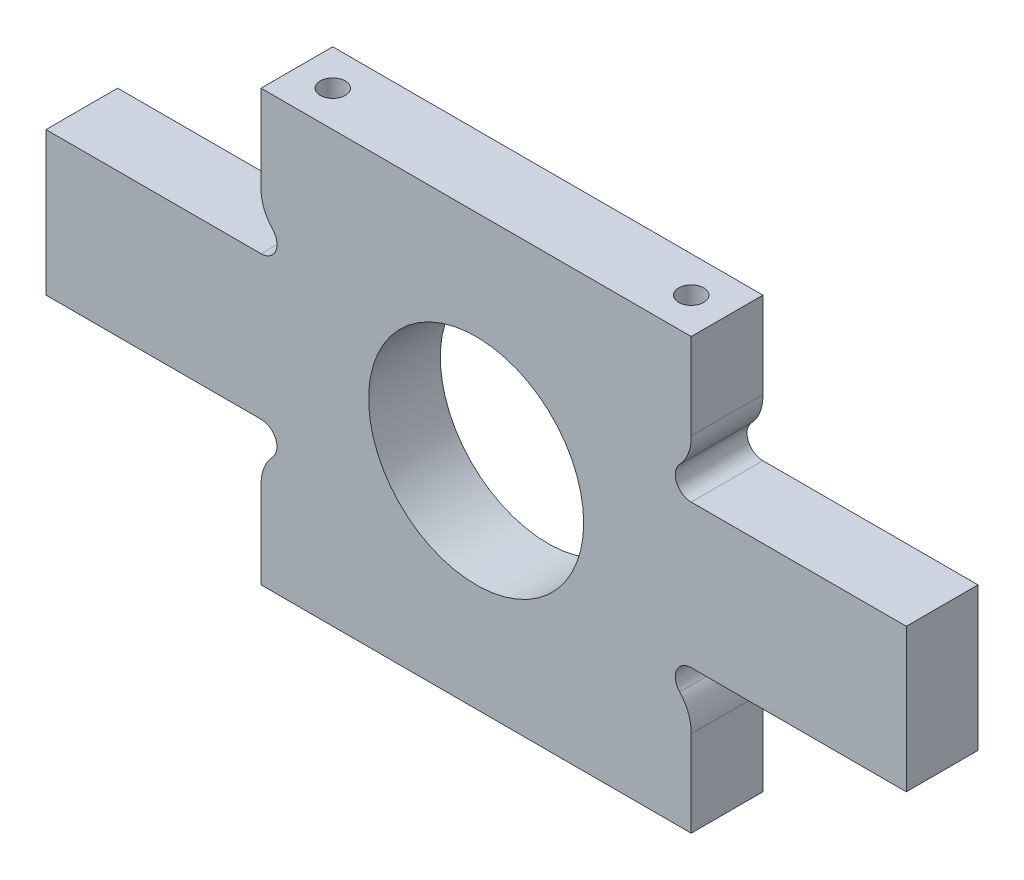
ISO-10303-21;
HEADER;
FILE_DESCRIPTION(('STEP AP214'),'2;1');
FILE_NAME('part.step','',(''),(''),'','','');
FILE_SCHEMA(('AUTOMOTIVE_DESIGN { 1 0 10303 214 1 1 1 1 }'));
ENDSEC;
DATA;
#1=APPLICATION_CONTEXT('core data for automotive mechanical design processes');
#2=APPLICATION_PROTOCOL_DEFINITION('international standard','automotive_design',2000,#1);
#3=PRODUCT_CONTEXT('',#1,'mechanical');
#4=PRODUCT('Part','Part','',(#3));
#5=PRODUCT_RELATED_PRODUCT_CATEGORY('part','',(#4));
#6=PRODUCT_DEFINITION_FORMATION('','',#4);
#7=PRODUCT_DEFINITION_CONTEXT('part definition',#1,'design');
#8=PRODUCT_DEFINITION('design','',#6,#7);
#9=PRODUCT_DEFINITION_SHAPE('','',#8);
#10=(LENGTH_UNIT() NAMED_UNIT(*) SI_UNIT(.MILLI.,.METRE.));
#11=(NAMED_UNIT(*) PLANE_ANGLE_UNIT() SI_UNIT($,.RADIAN.));
#12=(NAMED_UNIT(*) SI_UNIT($,.STERADIAN.) SOLID_ANGLE_UNIT());
#13=UNCERTAINTY_MEASURE_WITH_UNIT(LENGTH_MEASURE(1.E-05),#10,'distance_accuracy_value','');
#14=(GEOMETRIC_REPRESENTATION_CONTEXT(3) GLOBAL_UNCERTAINTY_ASSIGNED_CONTEXT((#13)) GLOBAL_UNIT_ASSIGNED_CONTEXT((#10,
#11,#12)) REPRESENTATION_CONTEXT('',''));
#15=CARTESIAN_POINT('',(0.,0.,0.));
#16=DIRECTION('',(0.,0.,1.));
#17=DIRECTION('',(1.,0.,0.));
#18=AXIS2_PLACEMENT_3D('',#15,#16,#17);
#19=CARTESIAN_POINT('',(24.0021116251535,17.8408301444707,10.));
#20=DIRECTION('',(0.,0.,-1.));
#21=DIRECTION('',(-1.,0.,0.));
#22=AXIS2_PLACEMENT_3D('',#19,#20,#21);
#23=CYLINDRICAL_SURFACE('',#22,6.00000000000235);
#24=CARTESIAN_POINT('',(24.0021116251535,17.8408301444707,0.));
#25=DIRECTION('',(0.,0.,1.));
#26=DIRECTION('',(-1.,0.,0.));
#27=AXIS2_PLACEMENT_3D('',#24,#25,#26);
#28=CIRCLE('',#27,6.00000000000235);
#29=CARTESIAN_POINT('',(28.3795620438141,13.7374257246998,0.));
#30=VERTEX_POINT('',#29);
#31=CARTESIAN_POINT('',(30.,18.,0.));
#32=VERTEX_POINT('',#31);
#33=EDGE_CURVE('E212',#30,#32,#28,.T.);
#34=ORIENTED_EDGE('',*,*,#33,.T.);
#35=DIRECTION('',(0.,0.,-1.));
#36=VECTOR('',#35,1.);
#37=CARTESIAN_POINT('',(30.,18.,10.));
#38=LINE('',#37,#36);
#39=CARTESIAN_POINT('',(30.,18.,10.));
#40=VERTEX_POINT('',#39);
#41=EDGE_CURVE('E11',#40,#32,#38,.T.);
#42=ORIENTED_EDGE('',*,*,#41,.F.);
#43=CARTESIAN_POINT('',(24.0021116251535,17.8408301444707,10.));
#44=DIRECTION('',(0.,0.,1.));
#45=DIRECTION('',(-1.,0.,0.));
#46=AXIS2_PLACEMENT_3D('',#43,#44,#45);
#47=CIRCLE('',#46,6.00000000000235);
#48=CARTESIAN_POINT('',(28.3795620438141,13.7374257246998,10.));
#49=VERTEX_POINT('',#48);
#50=EDGE_CURVE('E251',#49,#40,#47,.T.);
#51=ORIENTED_EDGE('',*,*,#50,.F.);
#52=DIRECTION('',(0.,0.,-1.));
#53=VECTOR('',#52,1.);
#54=CARTESIAN_POINT('',(28.3795620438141,13.7374257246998,10.));
#55=LINE('',#54,#53);
#56=EDGE_CURVE('E208',#49,#30,#55,.T.);
#57=ORIENTED_EDGE('',*,*,#56,.T.);
#58=EDGE_LOOP('',(#34,#42,#51,#57));
#59=FACE_BOUND('',#58,.T.);
#60=ADVANCED_FACE('F44',(#59),#23,.T.);
#61=CARTESIAN_POINT('',(30.,30.,10.));
#62=DIRECTION('',(-1.,0.,0.));
#63=DIRECTION('',(0.,-1.,0.));
#64=AXIS2_PLACEMENT_3D('',#61,#62,#63);
#65=PLANE('',#64);
#66=DIRECTION('',(0.,1.,0.));
#67=VECTOR('',#66,1.);
#68=CARTESIAN_POINT('',(30.,30.,0.));
#69=LINE('',#68,#67);
#70=CARTESIAN_POINT('',(30.,30.,0.));
#71=VERTEX_POINT('',#70);
#72=EDGE_CURVE('E215',#32,#71,#69,.T.);
#73=ORIENTED_EDGE('',*,*,#72,.T.);
#74=DIRECTION('',(0.,0.,-1.));
#75=VECTOR('',#74,1.);
#76=CARTESIAN_POINT('',(30.,30.,10.));
#77=LINE('',#76,#75);
#78=CARTESIAN_POINT('',(30.,30.,10.));
#79=VERTEX_POINT('',#78);
#80=EDGE_CURVE('E52',#79,#71,#77,.T.);
#81=ORIENTED_EDGE('',*,*,#80,.F.);
#82=DIRECTION('',(0.,1.,0.));
#83=VECTOR('',#82,1.);
#84=CARTESIAN_POINT('',(30.,30.,10.));
#85=LINE('',#84,#83);
#86=EDGE_CURVE('E139',#40,#79,#85,.T.);
#87=ORIENTED_EDGE('',*,*,#86,.F.);
#88=ORIENTED_EDGE('',*,*,#41,.T.);
#89=EDGE_LOOP('',(#73,#81,#87,#88));
#90=FACE_BOUND('',#89,.T.);
#91=ADVANCED_FACE('F370',(#90),#65,.F.);
#92=CARTESIAN_POINT('',(30.,30.,10.));
#93=DIRECTION('',(0.,-1.,0.));
#94=DIRECTION('',(1.,0.,0.));
#95=AXIS2_PLACEMENT_3D('',#92,#93,#94);
#96=PLANE('',#95);
#97=CARTESIAN_POINT('',(-25.,30.,5.));
#98=DIRECTION('',(0.,1.,0.));
#99=DIRECTION('',(0.,0.,1.));
#100=AXIS2_PLACEMENT_3D('',#97,#98,#99);
#101=CIRCLE('',#100,1.74999999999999);
#102=CARTESIAN_POINT('',(-25.,30.,6.74999999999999));
#103=VERTEX_POINT('',#102);
#104=EDGE_CURVE('E496',#103,#103,#101,.T.);
#105=ORIENTED_EDGE('',*,*,#104,.F.);
#106=EDGE_LOOP('',(#105));
#107=FACE_BOUND('',#106,.T.);
#108=CARTESIAN_POINT('',(25.,30.,5.));
#109=DIRECTION('',(0.,1.,0.));
#110=DIRECTION('',(0.,0.,1.));
#111=AXIS2_PLACEMENT_3D('',#108,#109,#110);
#112=CIRCLE('',#111,1.74999999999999);
#113=CARTESIAN_POINT('',(25.,30.,6.74999999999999));
#114=VERTEX_POINT('',#113);
#115=EDGE_CURVE('E498',#114,#114,#112,.T.);
#116=ORIENTED_EDGE('',*,*,#115,.F.);
#117=EDGE_LOOP('',(#116));
#118=FACE_BOUND('',#117,.T.);
#119=DIRECTION('',(-1.,0.,0.));
#120=VECTOR('',#119,1.);
#121=CARTESIAN_POINT('',(30.,30.,0.));
#122=LINE('',#121,#120);
#123=CARTESIAN_POINT('',(-30.,30.,0.));
#124=VERTEX_POINT('',#123);
#125=EDGE_CURVE('E218',#71,#124,#122,.T.);
#126=ORIENTED_EDGE('',*,*,#125,.T.);
#127=DIRECTION('',(0.,0.,-1.));
#128=VECTOR('',#127,1.);
#129=CARTESIAN_POINT('',(-30.,30.,10.));
#130=LINE('',#129,#128);
#131=CARTESIAN_POINT('',(-30.,30.,10.));
#132=VERTEX_POINT('',#131);
#133=EDGE_CURVE('E294',#132,#124,#130,.T.);
#134=ORIENTED_EDGE('',*,*,#133,.F.);
#135=DIRECTION('',(-1.,0.,0.));
#136=VECTOR('',#135,1.);
#137=CARTESIAN_POINT('',(30.,30.,10.));
#138=LINE('',#137,#136);
#139=EDGE_CURVE('E302',#79,#132,#138,.T.);
#140=ORIENTED_EDGE('',*,*,#139,.F.);
#141=ORIENTED_EDGE('',*,*,#80,.T.);
#142=EDGE_LOOP('',(#126,#134,#140,#141));
#143=FACE_BOUND('',#142,.T.);
#144=ADVANCED_FACE('F300',(#107,#118,#143),#96,.F.);
#145=CARTESIAN_POINT('',(-30.,30.,10.));
#146=DIRECTION('',(1.,0.,0.));
#147=DIRECTION('',(0.,1.,0.));
#148=AXIS2_PLACEMENT_3D('',#145,#146,#147);
#149=PLANE('',#148);
#150=DIRECTION('',(0.,-1.,0.));
#151=VECTOR('',#150,1.);
#152=CARTESIAN_POINT('',(-30.,30.,0.));
#153=LINE('',#152,#151);
#154=CARTESIAN_POINT('',(-30.,18.,0.));
#155=VERTEX_POINT('',#154);
#156=EDGE_CURVE('E220',#124,#155,#153,.T.);
#157=ORIENTED_EDGE('',*,*,#156,.T.);
#158=DIRECTION('',(0.,0.,-1.));
#159=VECTOR('',#158,1.);
#160=CARTESIAN_POINT('',(-30.,18.,10.));
#161=LINE('',#160,#159);
#162=CARTESIAN_POINT('',(-30.,18.,10.));
#163=VERTEX_POINT('',#162);
#164=EDGE_CURVE('E291',#163,#155,#161,.T.);
#165=ORIENTED_EDGE('',*,*,#164,.F.);
#166=DIRECTION('',(0.,-1.,0.));
#167=VECTOR('',#166,1.);
#168=CARTESIAN_POINT('',(-30.,30.,10.));
#169=LINE('',#168,#167);
#170=EDGE_CURVE('E320',#132,#163,#169,.T.);
#171=ORIENTED_EDGE('',*,*,#170,.F.);
#172=ORIENTED_EDGE('',*,*,#133,.T.);
#173=EDGE_LOOP('',(#157,#165,#171,#172));
#174=FACE_BOUND('',#173,.T.);
#175=ADVANCED_FACE('F311',(#174),#149,.F.);
#176=CARTESIAN_POINT('',(-24.0021116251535,17.8408301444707,10.));
#177=DIRECTION('',(0.,0.,-1.));
#178=DIRECTION('',(-1.,0.,0.));
#179=AXIS2_PLACEMENT_3D('',#176,#177,#178);
#180=CYLINDRICAL_SURFACE('',#179,6.00000000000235);
#181=CARTESIAN_POINT('',(-24.0021116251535,17.8408301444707,0.));
#182=DIRECTION('',(0.,0.,1.));
#183=DIRECTION('',(1.,0.,0.));
#184=AXIS2_PLACEMENT_3D('',#181,#182,#183);
#185=CIRCLE('',#184,6.00000000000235);
#186=CARTESIAN_POINT('',(-28.3795620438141,13.7374257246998,0.));
#187=VERTEX_POINT('',#186);
#188=EDGE_CURVE('E222',#155,#187,#185,.T.);
#189=ORIENTED_EDGE('',*,*,#188,.T.);
#190=DIRECTION('',(0.,0.,-1.));
#191=VECTOR('',#190,1.);
#192=CARTESIAN_POINT('',(-28.3795620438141,13.7374257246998,10.));
#193=LINE('',#192,#191);
#194=CARTESIAN_POINT('',(-28.3795620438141,13.7374257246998,10.));
#195=VERTEX_POINT('',#194);
#196=EDGE_CURVE('E288',#195,#187,#193,.T.);
#197=ORIENTED_EDGE('',*,*,#196,.F.);
#198=CARTESIAN_POINT('',(-24.0021116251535,17.8408301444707,10.));
#199=DIRECTION('',(0.,0.,1.));
#200=DIRECTION('',(1.,0.,0.));
#201=AXIS2_PLACEMENT_3D('',#198,#199,#200);
#202=CIRCLE('',#201,6.00000000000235);
#203=EDGE_CURVE('E317',#163,#195,#202,.T.);
#204=ORIENTED_EDGE('',*,*,#203,.F.);
#205=ORIENTED_EDGE('',*,*,#164,.T.);
#206=EDGE_LOOP('',(#189,#197,#204,#205));
#207=FACE_BOUND('',#206,.T.);
#208=ADVANCED_FACE('F315',(#207),#180,.T.);
#209=CARTESIAN_POINT('',(-30.000000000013,12.2199999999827,10.));
#210=DIRECTION('',(0.,0.,-1.));
#211=DIRECTION('',(-1.,0.,0.));
#212=AXIS2_PLACEMENT_3D('',#209,#210,#211);
#213=CYLINDRICAL_SURFACE('',#212,2.21999999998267);
#214=CARTESIAN_POINT('',(-30.000000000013,12.2199999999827,0.));
#215=DIRECTION('',(0.,0.,-1.));
#216=DIRECTION('',(1.,0.,0.));
#217=AXIS2_PLACEMENT_3D('',#214,#215,#216);
#218=CIRCLE('',#217,2.21999999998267);
#219=CARTESIAN_POINT('',(-30.000000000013,10.,0.));
#220=VERTEX_POINT('',#219);
#221=EDGE_CURVE('E224',#187,#220,#218,.T.);
#222=ORIENTED_EDGE('',*,*,#221,.T.);
#223=DIRECTION('',(0.,0.,-1.));
#224=VECTOR('',#223,1.);
#225=CARTESIAN_POINT('',(-30.000000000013,10.,10.));
#226=LINE('',#225,#224);
#227=CARTESIAN_POINT('',(-30.000000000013,10.,10.));
#228=VERTEX_POINT('',#227);
#229=EDGE_CURVE('E285',#228,#220,#226,.T.);
#230=ORIENTED_EDGE('',*,*,#229,.F.);
#231=CARTESIAN_POINT('',(-30.000000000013,12.2199999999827,10.));
#232=DIRECTION('',(0.,0.,-1.));
#233=DIRECTION('',(1.,0.,0.));
#234=AXIS2_PLACEMENT_3D('',#231,#232,#233);
#235=CIRCLE('',#234,2.21999999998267);
#236=EDGE_CURVE('E319',#195,#228,#235,.T.);
#237=ORIENTED_EDGE('',*,*,#236,.F.);
#238=ORIENTED_EDGE('',*,*,#196,.T.);
#239=EDGE_LOOP('',(#222,#230,#237,#238));
#240=FACE_BOUND('',#239,.T.);
#241=ADVANCED_FACE('F384',(#240),#213,.F.);
#242=CARTESIAN_POINT('',(-30.000000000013,10.,10.));
#243=DIRECTION('',(0.,-1.,0.));
#244=DIRECTION('',(0.,0.,-1.));
#245=AXIS2_PLACEMENT_3D('',#242,#243,#244);
#246=PLANE('',#245);
#247=DIRECTION('',(-1.,0.,0.));
#248=VECTOR('',#247,1.);
#249=CARTESIAN_POINT('',(-30.000000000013,10.,0.));
#250=LINE('',#249,#248);
#251=CARTESIAN_POINT('',(-60.,10.,0.));
#252=VERTEX_POINT('',#251);
#253=EDGE_CURVE('E226',#220,#252,#250,.T.);
#254=ORIENTED_EDGE('',*,*,#253,.T.);
#255=DIRECTION('',(0.,0.,-1.));
#256=VECTOR('',#255,1.);
#257=CARTESIAN_POINT('',(-60.,10.,10.));
#258=LINE('',#257,#256);
#259=CARTESIAN_POINT('',(-60.,10.,10.));
#260=VERTEX_POINT('',#259);
#261=EDGE_CURVE('E282',#260,#252,#258,.T.);
#262=ORIENTED_EDGE('',*,*,#261,.F.);
#263=DIRECTION('',(-1.,0.,0.));
#264=VECTOR('',#263,1.);
#265=CARTESIAN_POINT('',(-30.000000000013,10.,10.));
#266=LINE('',#265,#264);
#267=EDGE_CURVE('E322',#228,#260,#266,.T.);
#268=ORIENTED_EDGE('',*,*,#267,.F.);
#269=ORIENTED_EDGE('',*,*,#229,.T.);
#270=EDGE_LOOP('',(#254,#262,#268,#269));
#271=FACE_BOUND('',#270,.T.);
#272=ADVANCED_FACE('F387',(#271),#246,.F.);
#273=CARTESIAN_POINT('',(-60.,10.,10.));
#274=DIRECTION('',(1.,0.,0.));
#275=DIRECTION('',(0.,0.,-1.));
#276=AXIS2_PLACEMENT_3D('',#273,#274,#275);
#277=PLANE('',#276);
#278=DIRECTION('',(0.,-1.,0.));
#279=VECTOR('',#278,1.);
#280=CARTESIAN_POINT('',(-60.,10.,0.));
#281=LINE('',#280,#279);
#282=CARTESIAN_POINT('',(-60.,-10.,0.));
#283=VERTEX_POINT('',#282);
#284=EDGE_CURVE('E228',#252,#283,#281,.T.);
#285=ORIENTED_EDGE('',*,*,#284,.T.);
#286=DIRECTION('',(0.,0.,-1.));
#287=VECTOR('',#286,1.);
#288=CARTESIAN_POINT('',(-60.,-10.,10.));
#289=LINE('',#288,#287);
#290=CARTESIAN_POINT('',(-60.,-10.,10.));
#291=VERTEX_POINT('',#290);
#292=EDGE_CURVE('E279',#291,#283,#289,.T.);
#293=ORIENTED_EDGE('',*,*,#292,.F.);
#294=DIRECTION('',(0.,-1.,0.));
#295=VECTOR('',#294,1.);
#296=CARTESIAN_POINT('',(-60.,10.,10.));
#297=LINE('',#296,#295);
#298=EDGE_CURVE('E328',#260,#291,#297,.T.);
#299=ORIENTED_EDGE('',*,*,#298,.F.);
#300=ORIENTED_EDGE('',*,*,#261,.T.);
#301=EDGE_LOOP('',(#285,#293,#299,#300));
#302=FACE_BOUND('',#301,.T.);
#303=ADVANCED_FACE('F391',(#302),#277,.F.);
#304=CARTESIAN_POINT('',(-60.,-10.,10.));
#305=DIRECTION('',(0.,1.,0.));
#306=DIRECTION('',(-1.,0.,0.));
#307=AXIS2_PLACEMENT_3D('',#304,#305,#306);
#308=PLANE('',#307);
#309=DIRECTION('',(1.,0.,0.));
#310=VECTOR('',#309,1.);
#311=CARTESIAN_POINT('',(-60.,-10.,0.));
#312=LINE('',#311,#310);
#313=CARTESIAN_POINT('',(-30.000000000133,-9.99999999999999,0.));
#314=VERTEX_POINT('',#313);
#315=EDGE_CURVE('E230',#283,#314,#312,.T.);
#316=ORIENTED_EDGE('',*,*,#315,.T.);
#317=DIRECTION('',(0.,0.,-1.));
#318=VECTOR('',#317,1.);
#319=CARTESIAN_POINT('',(-30.000000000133,-9.99999999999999,10.));
#320=LINE('',#319,#318);
#321=CARTESIAN_POINT('',(-30.000000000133,-9.99999999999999,10.));
#322=VERTEX_POINT('',#321);
#323=EDGE_CURVE('E276',#322,#314,#320,.T.);
#324=ORIENTED_EDGE('',*,*,#323,.F.);
#325=DIRECTION('',(1.,0.,0.));
#326=VECTOR('',#325,1.);
#327=CARTESIAN_POINT('',(-60.,-10.,10.));
#328=LINE('',#327,#326);
#329=EDGE_CURVE('E330',#291,#322,#328,.T.);
#330=ORIENTED_EDGE('',*,*,#329,.F.);
#331=ORIENTED_EDGE('',*,*,#292,.T.);
#332=EDGE_LOOP('',(#316,#324,#330,#331));
#333=FACE_BOUND('',#332,.T.);
#334=ADVANCED_FACE('F395',(#333),#308,.F.);
#335=CARTESIAN_POINT('',(-30.000000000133,-12.2200000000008,10.));
#336=DIRECTION('',(0.,0.,-1.));
#337=DIRECTION('',(-1.,0.,0.));
#338=AXIS2_PLACEMENT_3D('',#335,#336,#337);
#339=CYLINDRICAL_SURFACE('',#338,2.22000000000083);
#340=CARTESIAN_POINT('',(-30.000000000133,-12.2200000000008,0.));
#341=DIRECTION('',(0.,0.,-1.));
#342=DIRECTION('',(1.,0.,0.));
#343=AXIS2_PLACEMENT_3D('',#340,#341,#342);
#344=CIRCLE('',#343,2.22000000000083);
#345=CARTESIAN_POINT('',(-28.3795620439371,-13.7374257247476,0.));
#346=VERTEX_POINT('',#345);
#347=EDGE_CURVE('E232',#314,#346,#344,.T.);
#348=ORIENTED_EDGE('',*,*,#347,.T.);
#349=DIRECTION('',(0.,0.,-1.));
#350=VECTOR('',#349,1.);
#351=CARTESIAN_POINT('',(-28.3795620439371,-13.7374257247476,10.));
#352=LINE('',#351,#350);
#353=CARTESIAN_POINT('',(-28.3795620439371,-13.7374257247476,10.));
#354=VERTEX_POINT('',#353);
#355=EDGE_CURVE('E273',#354,#346,#352,.T.);
#356=ORIENTED_EDGE('',*,*,#355,.F.);
#357=CARTESIAN_POINT('',(-30.000000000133,-12.2200000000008,10.));
#358=DIRECTION('',(0.,0.,-1.));
#359=DIRECTION('',(1.,0.,0.));
#360=AXIS2_PLACEMENT_3D('',#357,#358,#359);
#361=CIRCLE('',#360,2.22000000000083);
#362=EDGE_CURVE('E332',#322,#354,#361,.T.);
#363=ORIENTED_EDGE('',*,*,#362,.F.);
#364=ORIENTED_EDGE('',*,*,#323,.T.);
#365=EDGE_LOOP('',(#348,#356,#363,#364));
#366=FACE_BOUND('',#365,.T.);
#367=ADVANCED_FACE('F399',(#366),#339,.F.);
#368=CARTESIAN_POINT('',(-24.0000000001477,-17.8385763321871,10.));
#369=DIRECTION('',(0.,0.,-1.));
#370=DIRECTION('',(-1.,0.,0.));
#371=AXIS2_PLACEMENT_3D('',#368,#369,#370);
#372=CYLINDRICAL_SURFACE('',#371,6.00000000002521);
#373=CARTESIAN_POINT('',(-24.0000000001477,-17.8385763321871,0.));
#374=DIRECTION('',(0.,0.,1.));
#375=DIRECTION('',(1.,0.,0.));
#376=AXIS2_PLACEMENT_3D('',#373,#374,#375);
#377=CIRCLE('',#376,6.00000000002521);
#378=CARTESIAN_POINT('',(-29.9978281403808,-18.,0.));
#379=VERTEX_POINT('',#378);
#380=EDGE_CURVE('E234',#346,#379,#377,.T.);
#381=ORIENTED_EDGE('',*,*,#380,.T.);
#382=DIRECTION('',(0.,0.,-1.));
#383=VECTOR('',#382,1.);
#384=CARTESIAN_POINT('',(-29.9978281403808,-18.,10.));
#385=LINE('',#384,#383);
#386=CARTESIAN_POINT('',(-29.9978281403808,-18.,10.));
#387=VERTEX_POINT('',#386);
#388=EDGE_CURVE('E270',#387,#379,#385,.T.);
#389=ORIENTED_EDGE('',*,*,#388,.F.);
#390=CARTESIAN_POINT('',(-24.0000000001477,-17.8385763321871,10.));
#391=DIRECTION('',(0.,0.,1.));
#392=DIRECTION('',(1.,0.,0.));
#393=AXIS2_PLACEMENT_3D('',#390,#391,#392);
#394=CIRCLE('',#393,6.00000000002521);
#395=EDGE_CURVE('E334',#354,#387,#394,.T.);
#396=ORIENTED_EDGE('',*,*,#395,.F.);
#397=ORIENTED_EDGE('',*,*,#355,.T.);
#398=EDGE_LOOP('',(#381,#389,#396,#397));
#399=FACE_BOUND('',#398,.T.);
#400=ADVANCED_FACE('F403',(#399),#372,.T.);
#401=CARTESIAN_POINT('',(-29.9978281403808,-18.,10.));
#402=DIRECTION('',(1.,0.,0.));
#403=DIRECTION('',(0.,0.,-1.));
#404=AXIS2_PLACEMENT_3D('',#401,#402,#403);
#405=PLANE('',#404);
#406=DIRECTION('',(0.,-1.,0.));
#407=VECTOR('',#406,1.);
#408=CARTESIAN_POINT('',(-29.9978281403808,-18.,0.));
#409=LINE('',#408,#407);
#410=CARTESIAN_POINT('',(-29.9978281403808,-30.,0.));
#411=VERTEX_POINT('',#410);
#412=EDGE_CURVE('E236',#379,#411,#409,.T.);
#413=ORIENTED_EDGE('',*,*,#412,.T.);
#414=DIRECTION('',(0.,0.,-1.));
#415=VECTOR('',#414,1.);
#416=CARTESIAN_POINT('',(-29.9978281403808,-30.,10.));
#417=LINE('',#416,#415);
#418=CARTESIAN_POINT('',(-29.9978281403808,-30.,10.));
#419=VERTEX_POINT('',#418);
#420=EDGE_CURVE('E267',#419,#411,#417,.T.);
#421=ORIENTED_EDGE('',*,*,#420,.F.);
#422=DIRECTION('',(0.,-1.,0.));
#423=VECTOR('',#422,1.);
#424=CARTESIAN_POINT('',(-29.9978281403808,-18.,10.));
#425=LINE('',#424,#423);
#426=EDGE_CURVE('E336',#387,#419,#425,.T.);
#427=ORIENTED_EDGE('',*,*,#426,.F.);
#428=ORIENTED_EDGE('',*,*,#388,.T.);
#429=EDGE_LOOP('',(#413,#421,#427,#428));
#430=FACE_BOUND('',#429,.T.);
#431=ADVANCED_FACE('F407',(#430),#405,.F.);
#432=CARTESIAN_POINT('',(-29.9978281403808,-30.,10.));
#433=DIRECTION('',(0.,1.,0.));
#434=DIRECTION('',(-1.,0.,0.));
#435=AXIS2_PLACEMENT_3D('',#432,#433,#434);
#436=PLANE('',#435);
#437=CARTESIAN_POINT('',(-25.,-30.,5.));
#438=DIRECTION('',(0.,1.,0.));
#439=DIRECTION('',(0.,0.,1.));
#440=AXIS2_PLACEMENT_3D('',#437,#438,#439);
#441=CIRCLE('',#440,1.74999999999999);
#442=CARTESIAN_POINT('',(-25.,-30.,6.74999999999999));
#443=VERTEX_POINT('',#442);
#444=EDGE_CURVE('E493',#443,#443,#441,.T.);
#445=ORIENTED_EDGE('',*,*,#444,.T.);
#446=EDGE_LOOP('',(#445));
#447=FACE_BOUND('',#446,.T.);
#448=CARTESIAN_POINT('',(25.,-30.,5.));
#449=DIRECTION('',(0.,1.,0.));
#450=DIRECTION('',(0.,0.,1.));
#451=AXIS2_PLACEMENT_3D('',#448,#449,#450);
#452=CIRCLE('',#451,1.74999999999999);
#453=CARTESIAN_POINT('',(25.,-30.,6.74999999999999));
#454=VERTEX_POINT('',#453);
#455=EDGE_CURVE('E503',#454,#454,#452,.T.);
#456=ORIENTED_EDGE('',*,*,#455,.T.);
#457=EDGE_LOOP('',(#456));
#458=FACE_BOUND('',#457,.T.);
#459=DIRECTION('',(1.,0.,0.));
#460=VECTOR('',#459,1.);
#461=CARTESIAN_POINT('',(-29.9978281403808,-30.,0.));
#462=LINE('',#461,#460);
#463=CARTESIAN_POINT('',(29.9978281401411,-30.,0.));
#464=VERTEX_POINT('',#463);
#465=EDGE_CURVE('E238',#411,#464,#462,.T.);
#466=ORIENTED_EDGE('',*,*,#465,.T.);
#467=DIRECTION('',(0.,0.,-1.));
#468=VECTOR('',#467,1.);
#469=CARTESIAN_POINT('',(29.9978281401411,-30.,10.));
#470=LINE('',#469,#468);
#471=CARTESIAN_POINT('',(29.9978281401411,-30.,10.));
#472=VERTEX_POINT('',#471);
#473=EDGE_CURVE('E264',#472,#464,#470,.T.);
#474=ORIENTED_EDGE('',*,*,#473,.F.);
#475=DIRECTION('',(1.,0.,0.));
#476=VECTOR('',#475,1.);
#477=CARTESIAN_POINT('',(-29.9978281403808,-30.,10.));
#478=LINE('',#477,#476);
#479=EDGE_CURVE('E338',#419,#472,#478,.T.);
#480=ORIENTED_EDGE('',*,*,#479,.F.);
#481=ORIENTED_EDGE('',*,*,#420,.T.);
#482=EDGE_LOOP('',(#466,#474,#480,#481));
#483=FACE_BOUND('',#482,.T.);
#484=ADVANCED_FACE('F411',(#447,#458,#483),#436,.F.);
#485=CARTESIAN_POINT('',(29.9978281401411,-30.,10.));
#486=DIRECTION('',(-1.,0.,0.));
#487=DIRECTION('',(0.,0.,1.));
#488=AXIS2_PLACEMENT_3D('',#485,#486,#487);
#489=PLANE('',#488);
#490=DIRECTION('',(0.,1.,0.));
#491=VECTOR('',#490,1.);
#492=CARTESIAN_POINT('',(29.9978281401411,-30.,0.));
#493=LINE('',#492,#491);
#494=CARTESIAN_POINT('',(29.9978281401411,-18.,0.));
#495=VERTEX_POINT('',#494);
#496=EDGE_CURVE('E240',#464,#495,#493,.T.);
#497=ORIENTED_EDGE('',*,*,#496,.T.);
#498=DIRECTION('',(0.,0.,-1.));
#499=VECTOR('',#498,1.);
#500=CARTESIAN_POINT('',(29.9978281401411,-18.,10.));
#501=LINE('',#500,#499);
#502=CARTESIAN_POINT('',(29.9978281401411,-18.,10.));
#503=VERTEX_POINT('',#502);
#504=EDGE_CURVE('E261',#503,#495,#501,.T.);
#505=ORIENTED_EDGE('',*,*,#504,.F.);
#506=DIRECTION('',(0.,1.,0.));
#507=VECTOR('',#506,1.);
#508=CARTESIAN_POINT('',(29.9978281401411,-30.,10.));
#509=LINE('',#508,#507);
#510=EDGE_CURVE('E340',#472,#503,#509,.T.);
#511=ORIENTED_EDGE('',*,*,#510,.F.);
#512=ORIENTED_EDGE('',*,*,#473,.T.);
#513=EDGE_LOOP('',(#497,#505,#511,#512));
#514=FACE_BOUND('',#513,.T.);
#515=ADVANCED_FACE('F415',(#514),#489,.F.);
#516=CARTESIAN_POINT('',(23.9999999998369,-17.8385763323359,10.));
#517=DIRECTION('',(0.,0.,-1.));
#518=DIRECTION('',(-1.,0.,0.));
#519=AXIS2_PLACEMENT_3D('',#516,#517,#518);
#520=CYLINDRICAL_SURFACE('',#519,6.00000000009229);
#521=CARTESIAN_POINT('',(23.9999999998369,-17.8385763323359,0.));
#522=DIRECTION('',(0.,0.,1.));
#523=DIRECTION('',(1.,0.,0.));
#524=AXIS2_PLACEMENT_3D('',#521,#522,#523);
#525=CIRCLE('',#524,6.00000000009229);
#526=CARTESIAN_POINT('',(28.3795620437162,-13.7374257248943,0.));
#527=VERTEX_POINT('',#526);
#528=EDGE_CURVE('E242',#495,#527,#525,.T.);
#529=ORIENTED_EDGE('',*,*,#528,.T.);
#530=DIRECTION('',(0.,0.,-1.));
#531=VECTOR('',#530,1.);
#532=CARTESIAN_POINT('',(28.3795620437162,-13.7374257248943,10.));
#533=LINE('',#532,#531);
#534=CARTESIAN_POINT('',(28.3795620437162,-13.7374257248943,10.));
#535=VERTEX_POINT('',#534);
#536=EDGE_CURVE('E258',#535,#527,#533,.T.);
#537=ORIENTED_EDGE('',*,*,#536,.F.);
#538=CARTESIAN_POINT('',(23.9999999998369,-17.8385763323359,10.));
#539=DIRECTION('',(0.,0.,1.));
#540=DIRECTION('',(1.,0.,0.));
#541=AXIS2_PLACEMENT_3D('',#538,#539,#540);
#542=CIRCLE('',#541,6.00000000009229);
#543=EDGE_CURVE('E342',#503,#535,#542,.T.);
#544=ORIENTED_EDGE('',*,*,#543,.F.);
#545=ORIENTED_EDGE('',*,*,#504,.T.);
#546=EDGE_LOOP('',(#529,#537,#544,#545));
#547=FACE_BOUND('',#546,.T.);
#548=ADVANCED_FACE('F419',(#547),#520,.T.);
#549=CARTESIAN_POINT('',(29.9999999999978,-12.2200000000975,10.));
#550=DIRECTION('',(0.,0.,-1.));
#551=DIRECTION('',(-1.,0.,0.));
#552=AXIS2_PLACEMENT_3D('',#549,#550,#551);
#553=CYLINDRICAL_SURFACE('',#552,2.22000000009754);
#554=CARTESIAN_POINT('',(29.9999999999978,-12.2200000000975,0.));
#555=DIRECTION('',(0.,0.,-1.));
#556=DIRECTION('',(1.,0.,0.));
#557=AXIS2_PLACEMENT_3D('',#554,#555,#556);
#558=CIRCLE('',#557,2.22000000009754);
#559=CARTESIAN_POINT('',(29.9999999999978,-10.,0.));
#560=VERTEX_POINT('',#559);
#561=EDGE_CURVE('E244',#527,#560,#558,.T.);
#562=ORIENTED_EDGE('',*,*,#561,.T.);
#563=DIRECTION('',(0.,0.,-1.));
#564=VECTOR('',#563,1.);
#565=CARTESIAN_POINT('',(29.9999999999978,-10.,10.));
#566=LINE('',#565,#564);
#567=CARTESIAN_POINT('',(29.9999999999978,-10.,10.));
#568=VERTEX_POINT('',#567);
#569=EDGE_CURVE('E255',#568,#560,#566,.T.);
#570=ORIENTED_EDGE('',*,*,#569,.F.);
#571=CARTESIAN_POINT('',(29.9999999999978,-12.2200000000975,10.));
#572=DIRECTION('',(0.,0.,-1.));
#573=DIRECTION('',(1.,0.,0.));
#574=AXIS2_PLACEMENT_3D('',#571,#572,#573);
#575=CIRCLE('',#574,2.22000000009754);
#576=EDGE_CURVE('E344',#535,#568,#575,.T.);
#577=ORIENTED_EDGE('',*,*,#576,.F.);
#578=ORIENTED_EDGE('',*,*,#536,.T.);
#579=EDGE_LOOP('',(#562,#570,#577,#578));
#580=FACE_BOUND('',#579,.T.);
#581=ADVANCED_FACE('F350',(#580),#553,.F.);
#582=CARTESIAN_POINT('',(29.9999999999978,-10.,10.));
#583=DIRECTION('',(0.,1.,0.));
#584=DIRECTION('',(-1.,0.,0.));
#585=AXIS2_PLACEMENT_3D('',#582,#583,#584);
#586=PLANE('',#585);
#587=DIRECTION('',(1.,0.,0.));
#588=VECTOR('',#587,1.);
#589=CARTESIAN_POINT('',(29.9999999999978,-10.,0.));
#590=LINE('',#589,#588);
#591=CARTESIAN_POINT('',(60.,-10.,0.));
#592=VERTEX_POINT('',#591);
#593=EDGE_CURVE('E246',#560,#592,#590,.T.);
#594=ORIENTED_EDGE('',*,*,#593,.T.);
#595=DIRECTION('',(0.,0.,-1.));
#596=VECTOR('',#595,1.);
#597=CARTESIAN_POINT('',(60.,-10.,10.));
#598=LINE('',#597,#596);
#599=CARTESIAN_POINT('',(60.,-10.,10.));
#600=VERTEX_POINT('',#599);
#601=EDGE_CURVE('E203',#600,#592,#598,.T.);
#602=ORIENTED_EDGE('',*,*,#601,.F.);
#603=DIRECTION('',(1.,0.,0.));
#604=VECTOR('',#603,1.);
#605=CARTESIAN_POINT('',(29.9999999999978,-10.,10.));
#606=LINE('',#605,#604);
#607=EDGE_CURVE('E194',#568,#600,#606,.T.);
#608=ORIENTED_EDGE('',*,*,#607,.F.);
#609=ORIENTED_EDGE('',*,*,#569,.T.);
#610=EDGE_LOOP('',(#594,#602,#608,#609));
#611=FACE_BOUND('',#610,.T.);
#612=ADVANCED_FACE('F354',(#611),#586,.F.);
#613=CARTESIAN_POINT('',(60.,-10.,10.));
#614=DIRECTION('',(-1.,0.,0.));
#615=DIRECTION('',(0.,0.,1.));
#616=AXIS2_PLACEMENT_3D('',#613,#614,#615);
#617=PLANE('',#616);
#618=DIRECTION('',(0.,1.,0.));
#619=VECTOR('',#618,1.);
#620=CARTESIAN_POINT('',(60.,-10.,0.));
#621=LINE('',#620,#619);
#622=CARTESIAN_POINT('',(60.,10.,0.));
#623=VERTEX_POINT('',#622);
#624=EDGE_CURVE('E202',#592,#623,#621,.T.);
#625=ORIENTED_EDGE('',*,*,#624,.T.);
#626=DIRECTION('',(0.,0.,-1.));
#627=VECTOR('',#626,1.);
#628=CARTESIAN_POINT('',(60.,10.,10.));
#629=LINE('',#628,#627);
#630=CARTESIAN_POINT('',(60.,10.,10.));
#631=VERTEX_POINT('',#630);
#632=EDGE_CURVE('E199',#631,#623,#629,.T.);
#633=ORIENTED_EDGE('',*,*,#632,.F.);
#634=DIRECTION('',(0.,1.,0.));
#635=VECTOR('',#634,1.);
#636=CARTESIAN_POINT('',(60.,-10.,10.));
#637=LINE('',#636,#635);
#638=EDGE_CURVE('E188',#600,#631,#637,.T.);
#639=ORIENTED_EDGE('',*,*,#638,.F.);
#640=ORIENTED_EDGE('',*,*,#601,.T.);
#641=EDGE_LOOP('',(#625,#633,#639,#640));
#642=FACE_BOUND('',#641,.T.);
#643=ADVANCED_FACE('F200',(#642),#617,.F.);
#644=CARTESIAN_POINT('',(60.,10.,10.));
#645=DIRECTION('',(0.,-1.,0.));
#646=DIRECTION('',(1.,0.,0.));
#647=AXIS2_PLACEMENT_3D('',#644,#645,#646);
#648=PLANE('',#647);
#649=DIRECTION('',(-1.,0.,0.));
#650=VECTOR('',#649,1.);
#651=CARTESIAN_POINT('',(60.,10.,0.));
#652=LINE('',#651,#650);
#653=CARTESIAN_POINT('',(30.000000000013,10.,0.));
#654=VERTEX_POINT('',#653);
#655=EDGE_CURVE('E125',#623,#654,#652,.T.);
#656=ORIENTED_EDGE('',*,*,#655,.T.);
#657=DIRECTION('',(0.,0.,-1.));
#658=VECTOR('',#657,1.);
#659=CARTESIAN_POINT('',(30.000000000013,10.,10.));
#660=LINE('',#659,#658);
#661=CARTESIAN_POINT('',(30.000000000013,10.,10.));
#662=VERTEX_POINT('',#661);
#663=EDGE_CURVE('E204',#662,#654,#660,.T.);
#664=ORIENTED_EDGE('',*,*,#663,.F.);
#665=DIRECTION('',(-1.,0.,0.));
#666=VECTOR('',#665,1.);
#667=CARTESIAN_POINT('',(60.,10.,10.));
#668=LINE('',#667,#666);
#669=EDGE_CURVE('E192',#631,#662,#668,.T.);
#670=ORIENTED_EDGE('',*,*,#669,.F.);
#671=ORIENTED_EDGE('',*,*,#632,.T.);
#672=EDGE_LOOP('',(#656,#664,#670,#671));
#673=FACE_BOUND('',#672,.T.);
#674=ADVANCED_FACE('F206',(#673),#648,.F.);
#675=CARTESIAN_POINT('',(30.000000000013,12.2199999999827,10.));
#676=DIRECTION('',(0.,0.,-1.));
#677=DIRECTION('',(-1.,0.,0.));
#678=AXIS2_PLACEMENT_3D('',#675,#676,#677);
#679=CYLINDRICAL_SURFACE('',#678,2.21999999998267);
#680=CARTESIAN_POINT('',(30.000000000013,12.2199999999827,0.));
#681=DIRECTION('',(0.,0.,-1.));
#682=DIRECTION('',(-1.,0.,0.));
#683=AXIS2_PLACEMENT_3D('',#680,#681,#682);
#684=CIRCLE('',#683,2.21999999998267);
#685=EDGE_CURVE('E131',#654,#30,#684,.T.);
#686=ORIENTED_EDGE('',*,*,#685,.T.);
#687=ORIENTED_EDGE('',*,*,#56,.F.);
#688=CARTESIAN_POINT('',(30.000000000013,12.2199999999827,10.));
#689=DIRECTION('',(0.,0.,-1.));
#690=DIRECTION('',(-1.,0.,0.));
#691=AXIS2_PLACEMENT_3D('',#688,#689,#690);
#692=CIRCLE('',#691,2.21999999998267);
#693=EDGE_CURVE('E60',#662,#49,#692,.T.);
#694=ORIENTED_EDGE('',*,*,#693,.F.);
#695=ORIENTED_EDGE('',*,*,#663,.T.);
#696=EDGE_LOOP('',(#686,#687,#694,#695));
#697=FACE_BOUND('',#696,.T.);
#698=ADVANCED_FACE('F358',(#697),#679,.F.);
#699=CARTESIAN_POINT('',(24.0021116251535,17.8408301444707,10.));
#700=DIRECTION('',(0.,0.,-1.));
#701=DIRECTION('',(-1.,0.,0.));
#702=AXIS2_PLACEMENT_3D('',#699,#700,#701);
#703=PLANE('',#702);
#704=CARTESIAN_POINT('',(0.,0.,10.));
#705=DIRECTION('',(0.,0.,1.));
#706=DIRECTION('',(1.,0.,0.));
#707=AXIS2_PLACEMENT_3D('',#704,#705,#706);
#708=CIRCLE('',#707,15.);
#709=CARTESIAN_POINT('',(15.,0.,10.));
#710=VERTEX_POINT('',#709);
#711=EDGE_CURVE('E506',#710,#710,#708,.T.);
#712=ORIENTED_EDGE('',*,*,#711,.F.);
#713=EDGE_LOOP('',(#712));
#714=FACE_BOUND('',#713,.T.);
#715=ORIENTED_EDGE('',*,*,#50,.T.);
#716=ORIENTED_EDGE('',*,*,#86,.T.);
#717=ORIENTED_EDGE('',*,*,#139,.T.);
#718=ORIENTED_EDGE('',*,*,#170,.T.);
#719=ORIENTED_EDGE('',*,*,#203,.T.);
#720=ORIENTED_EDGE('',*,*,#236,.T.);
#721=ORIENTED_EDGE('',*,*,#267,.T.);
#722=ORIENTED_EDGE('',*,*,#298,.T.);
#723=ORIENTED_EDGE('',*,*,#329,.T.);
#724=ORIENTED_EDGE('',*,*,#362,.T.);
#725=ORIENTED_EDGE('',*,*,#395,.T.);
#726=ORIENTED_EDGE('',*,*,#426,.T.);
#727=ORIENTED_EDGE('',*,*,#479,.T.);
#728=ORIENTED_EDGE('',*,*,#510,.T.);
#729=ORIENTED_EDGE('',*,*,#543,.T.);
#730=ORIENTED_EDGE('',*,*,#576,.T.);
#731=ORIENTED_EDGE('',*,*,#607,.T.);
#732=ORIENTED_EDGE('',*,*,#638,.T.);
#733=ORIENTED_EDGE('',*,*,#669,.T.);
#734=ORIENTED_EDGE('',*,*,#693,.T.);
#735=EDGE_LOOP('',(#715,#716,#717,#718,#719,#720,#721,#722,#723,#724,#725,#726,#727,#728,#729,
#730,#731,#732,#733,#734));
#736=FACE_BOUND('',#735,.T.);
#737=ADVANCED_FACE('F190',(#714,#736),#703,.F.);
#738=CARTESIAN_POINT('',(24.0021116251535,17.8408301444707,0.));
#739=DIRECTION('',(0.,0.,-1.));
#740=DIRECTION('',(-1.,0.,0.));
#741=AXIS2_PLACEMENT_3D('',#738,#739,#740);
#742=PLANE('',#741);
#743=CARTESIAN_POINT('',(0.,0.,0.));
#744=DIRECTION('',(0.,0.,1.));
#745=DIRECTION('',(1.,0.,0.));
#746=AXIS2_PLACEMENT_3D('',#743,#744,#745);
#747=CIRCLE('',#746,15.);
#748=CARTESIAN_POINT('',(15.,0.,0.));
#749=VERTEX_POINT('',#748);
#750=EDGE_CURVE('E216',#749,#749,#747,.T.);
#751=ORIENTED_EDGE('',*,*,#750,.T.);
#752=EDGE_LOOP('',(#751));
#753=FACE_BOUND('',#752,.T.);
#754=ORIENTED_EDGE('',*,*,#33,.F.);
#755=ORIENTED_EDGE('',*,*,#685,.F.);
#756=ORIENTED_EDGE('',*,*,#655,.F.);
#757=ORIENTED_EDGE('',*,*,#624,.F.);
#758=ORIENTED_EDGE('',*,*,#593,.F.);
#759=ORIENTED_EDGE('',*,*,#561,.F.);
#760=ORIENTED_EDGE('',*,*,#528,.F.);
#761=ORIENTED_EDGE('',*,*,#496,.F.);
#762=ORIENTED_EDGE('',*,*,#465,.F.);
#763=ORIENTED_EDGE('',*,*,#412,.F.);
#764=ORIENTED_EDGE('',*,*,#380,.F.);
#765=ORIENTED_EDGE('',*,*,#347,.F.);
#766=ORIENTED_EDGE('',*,*,#315,.F.);
#767=ORIENTED_EDGE('',*,*,#284,.F.);
#768=ORIENTED_EDGE('',*,*,#253,.F.);
#769=ORIENTED_EDGE('',*,*,#221,.F.);
#770=ORIENTED_EDGE('',*,*,#188,.F.);
#771=ORIENTED_EDGE('',*,*,#156,.F.);
#772=ORIENTED_EDGE('',*,*,#125,.F.);
#773=ORIENTED_EDGE('',*,*,#72,.F.);
#774=EDGE_LOOP('',(#754,#755,#756,#757,#758,#759,#760,#761,#762,#763,#764,#765,#766,#767,#768,
#769,#770,#771,#772,#773));
#775=FACE_BOUND('',#774,.T.);
#776=ADVANCED_FACE('F306',(#753,#775),#742,.T.);
#777=CARTESIAN_POINT('',(0.,0.,0.));
#778=DIRECTION('',(0.,0.,1.));
#779=DIRECTION('',(1.,0.,0.));
#780=AXIS2_PLACEMENT_3D('',#777,#778,#779);
#781=CYLINDRICAL_SURFACE('',#780,15.);
#782=ORIENTED_EDGE('',*,*,#750,.F.);
#783=EDGE_LOOP('',(#782));
#784=FACE_BOUND('',#783,.T.);
#785=ORIENTED_EDGE('',*,*,#711,.T.);
#786=EDGE_LOOP('',(#785));
#787=FACE_BOUND('',#786,.T.);
#788=ADVANCED_FACE('F458',(#784,#787),#781,.F.);
#789=CARTESIAN_POINT('',(25.,30.,5.));
#790=DIRECTION('',(0.,1.,0.));
#791=DIRECTION('',(0.,0.,1.));
#792=AXIS2_PLACEMENT_3D('',#789,#790,#791);
#793=CYLINDRICAL_SURFACE('',#792,1.74999999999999);
#794=ORIENTED_EDGE('',*,*,#455,.F.);
#795=EDGE_LOOP('',(#794));
#796=FACE_BOUND('',#795,.T.);
#797=ORIENTED_EDGE('',*,*,#115,.T.);
#798=EDGE_LOOP('',(#797));
#799=FACE_BOUND('',#798,.T.);
#800=ADVANCED_FACE('F467',(#796,#799),#793,.F.);
#801=CARTESIAN_POINT('',(-25.,30.,5.));
#802=DIRECTION('',(0.,1.,0.));
#803=DIRECTION('',(0.,0.,1.));
#804=AXIS2_PLACEMENT_3D('',#801,#802,#803);
#805=CYLINDRICAL_SURFACE('',#804,1.74999999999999);
#806=ORIENTED_EDGE('',*,*,#444,.F.);
#807=EDGE_LOOP('',(#806));
#808=FACE_BOUND('',#807,.T.);
#809=ORIENTED_EDGE('',*,*,#104,.T.);
#810=EDGE_LOOP('',(#809));
#811=FACE_BOUND('',#810,.T.);
#812=ADVANCED_FACE('F477',(#808,#811),#805,.F.);
#813=CLOSED_SHELL('',(#60,#91,#144,#175,#208,#241,#272,#303,#334,#367,#400,#431,#484,#515,#548,
#581,#612,#643,#674,#698,#737,#776,#788,#800,#812));
#814=MANIFOLD_SOLID_BREP('B2',#813);
#815=ADVANCED_BREP_SHAPE_REPRESENTATION('',(#18,#814),#14);
#816=SHAPE_DEFINITION_REPRESENTATION(#9,#815);
ENDSEC;
END-ISO-10303-21;
